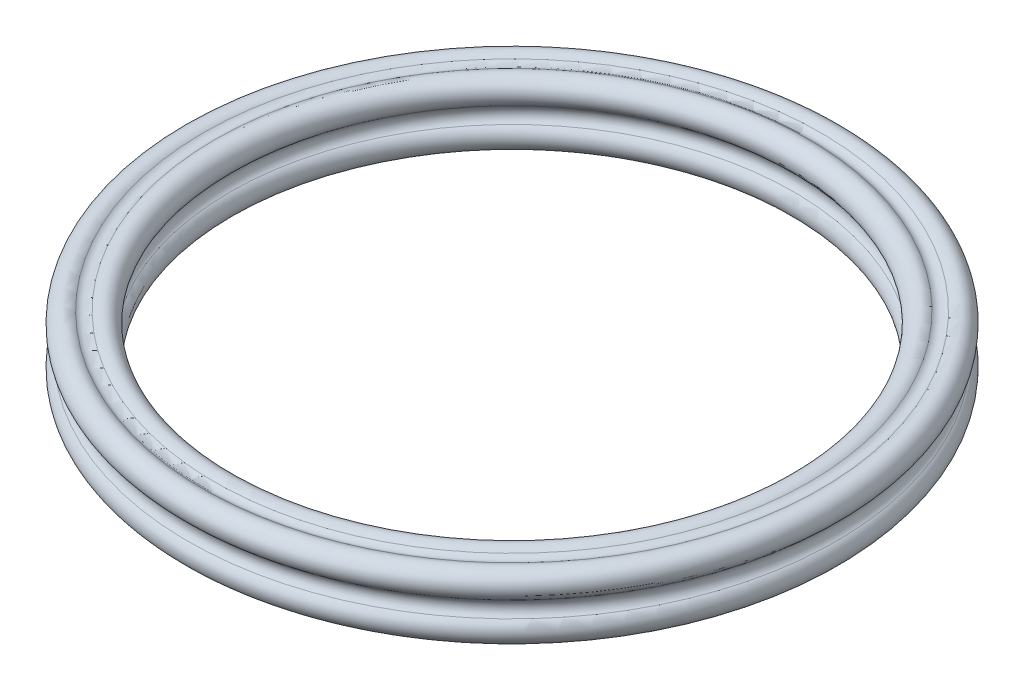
ISO-10303-21;
HEADER;
FILE_DESCRIPTION(('STEP AP214'),'2;1');
FILE_NAME('part.step','',(''),(''),'','','');
FILE_SCHEMA(('AUTOMOTIVE_DESIGN { 1 0 10303 214 1 1 1 1 }'));
ENDSEC;
DATA;
#1=APPLICATION_CONTEXT('core data for automotive mechanical design processes');
#2=APPLICATION_PROTOCOL_DEFINITION('international standard','automotive_design',2000,#1);
#3=PRODUCT_CONTEXT('',#1,'mechanical');
#4=PRODUCT('Part','Part','',(#3));
#5=PRODUCT_RELATED_PRODUCT_CATEGORY('part','',(#4));
#6=PRODUCT_DEFINITION_FORMATION('','',#4);
#7=PRODUCT_DEFINITION_CONTEXT('part definition',#1,'design');
#8=PRODUCT_DEFINITION('design','',#6,#7);
#9=PRODUCT_DEFINITION_SHAPE('','',#8);
#10=(LENGTH_UNIT() NAMED_UNIT(*) SI_UNIT(.MILLI.,.METRE.));
#11=(NAMED_UNIT(*) PLANE_ANGLE_UNIT() SI_UNIT($,.RADIAN.));
#12=(NAMED_UNIT(*) SI_UNIT($,.STERADIAN.) SOLID_ANGLE_UNIT());
#13=UNCERTAINTY_MEASURE_WITH_UNIT(LENGTH_MEASURE(1.E-05),#10,'distance_accuracy_value','');
#14=(GEOMETRIC_REPRESENTATION_CONTEXT(3) GLOBAL_UNCERTAINTY_ASSIGNED_CONTEXT((#13)) GLOBAL_UNIT_ASSIGNED_CONTEXT((#10,
#11,#12)) REPRESENTATION_CONTEXT('',''));
#15=CARTESIAN_POINT('',(0.,0.,0.));
#16=DIRECTION('',(0.,0.,1.));
#17=DIRECTION('',(1.,0.,0.));
#18=AXIS2_PLACEMENT_3D('',#15,#16,#17);
#19=CARTESIAN_POINT('',(0.,-0.33219918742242,0.));
#20=DIRECTION('',(0.,1.,0.));
#21=DIRECTION('',(-1.,0.,0.));
#22=AXIS2_PLACEMENT_3D('',#19,#20,#21);
#23=TOROIDAL_SURFACE('',#22,18.375,0.60089257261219);
#24=CARTESIAN_POINT('',(0.,0.153441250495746,0.));
#25=DIRECTION('',(0.,1.,0.));
#26=DIRECTION('',(-1.,0.,0.));
#27=AXIS2_PLACEMENT_3D('',#24,#25,#26);
#28=CIRCLE('',#27,18.0211282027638);
#29=CARTESIAN_POINT('',(-18.0211282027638,0.153441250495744,0.));
#30=VERTEX_POINT('',#29);
#31=EDGE_CURVE('E59',#30,#30,#28,.T.);
#32=ORIENTED_EDGE('',*,*,#31,.T.);
#33=EDGE_LOOP('',(#32));
#34=FACE_BOUND('',#33,.T.);
#35=CARTESIAN_POINT('',(0.,0.153441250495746,0.));
#36=DIRECTION('',(0.,1.,0.));
#37=DIRECTION('',(-1.,0.,0.));
#38=AXIS2_PLACEMENT_3D('',#35,#36,#37);
#39=CIRCLE('',#38,18.7288717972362);
#40=CARTESIAN_POINT('',(-18.7288717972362,0.153441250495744,0.));
#41=VERTEX_POINT('',#40);
#42=EDGE_CURVE('E10',#41,#41,#39,.T.);
#43=ORIENTED_EDGE('',*,*,#42,.F.);
#44=EDGE_LOOP('',(#43));
#45=FACE_BOUND('',#44,.T.);
#46=ADVANCED_FACE('F31',(#34,#45),#23,.F.);
#47=CARTESIAN_POINT('',(0.,0.800000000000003,0.));
#48=DIRECTION('',(0.,1.,0.));
#49=DIRECTION('',(-1.,0.,0.));
#50=AXIS2_PLACEMENT_3D('',#47,#48,#49);
#51=TOROIDAL_SURFACE('',#50,19.2,0.799999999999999);
#52=ORIENTED_EDGE('',*,*,#42,.T.);
#53=EDGE_LOOP('',(#52));
#54=FACE_BOUND('',#53,.T.);
#55=CARTESIAN_POINT('',(0.,1.45672416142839,0.));
#56=DIRECTION('',(0.,1.,0.));
#57=DIRECTION('',(-1.,0.,0.));
#58=AXIS2_PLACEMENT_3D('',#55,#56,#57);
#59=CIRCLE('',#58,19.6568515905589);
#60=CARTESIAN_POINT('',(-19.6568515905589,1.45672416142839,0.));
#61=VERTEX_POINT('',#60);
#62=EDGE_CURVE('E37',#61,#61,#59,.T.);
#63=ORIENTED_EDGE('',*,*,#62,.F.);
#64=EDGE_LOOP('',(#63));
#65=FACE_BOUND('',#64,.T.);
#66=ADVANCED_FACE('F77',(#54,#65),#51,.T.);
#67=CARTESIAN_POINT('',(0.,1.95,0.));
#68=DIRECTION('',(0.,1.,0.));
#69=DIRECTION('',(-1.,0.,0.));
#70=AXIS2_PLACEMENT_3D('',#67,#68,#69);
#71=TOROIDAL_SURFACE('',#70,20.,0.60089257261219);
#72=ORIENTED_EDGE('',*,*,#62,.T.);
#73=EDGE_LOOP('',(#72));
#74=FACE_BOUND('',#73,.T.);
#75=CARTESIAN_POINT('',(0.,2.44327583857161,0.));
#76=DIRECTION('',(0.,1.,0.));
#77=DIRECTION('',(-1.,0.,0.));
#78=AXIS2_PLACEMENT_3D('',#75,#76,#77);
#79=CIRCLE('',#78,19.6568515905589);
#80=CARTESIAN_POINT('',(-19.6568515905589,2.44327583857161,0.));
#81=VERTEX_POINT('',#80);
#82=EDGE_CURVE('E41',#81,#81,#79,.T.);
#83=ORIENTED_EDGE('',*,*,#82,.F.);
#84=EDGE_LOOP('',(#83));
#85=FACE_BOUND('',#84,.T.);
#86=ADVANCED_FACE('F81',(#74,#85),#71,.F.);
#87=CARTESIAN_POINT('',(0.,3.1,0.));
#88=DIRECTION('',(0.,1.,0.));
#89=DIRECTION('',(-1.,0.,0.));
#90=AXIS2_PLACEMENT_3D('',#87,#88,#89);
#91=TOROIDAL_SURFACE('',#90,19.2,0.799999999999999);
#92=ORIENTED_EDGE('',*,*,#82,.T.);
#93=EDGE_LOOP('',(#92));
#94=FACE_BOUND('',#93,.T.);
#95=CARTESIAN_POINT('',(0.,3.74655874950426,0.));
#96=DIRECTION('',(0.,1.,0.));
#97=DIRECTION('',(-1.,0.,0.));
#98=AXIS2_PLACEMENT_3D('',#95,#96,#97);
#99=CIRCLE('',#98,18.7288717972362);
#100=CARTESIAN_POINT('',(-18.7288717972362,3.74655874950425,0.));
#101=VERTEX_POINT('',#100);
#102=EDGE_CURVE('E45',#101,#101,#99,.T.);
#103=ORIENTED_EDGE('',*,*,#102,.F.);
#104=EDGE_LOOP('',(#103));
#105=FACE_BOUND('',#104,.T.);
#106=ADVANCED_FACE('F85',(#94,#105),#91,.T.);
#107=CARTESIAN_POINT('',(0.,4.23219918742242,0.));
#108=DIRECTION('',(0.,1.,0.));
#109=DIRECTION('',(-1.,0.,0.));
#110=AXIS2_PLACEMENT_3D('',#107,#108,#109);
#111=TOROIDAL_SURFACE('',#110,18.375,0.60089257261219);
#112=ORIENTED_EDGE('',*,*,#102,.T.);
#113=EDGE_LOOP('',(#112));
#114=FACE_BOUND('',#113,.T.);
#115=CARTESIAN_POINT('',(0.,3.74655874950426,0.));
#116=DIRECTION('',(0.,1.,0.));
#117=DIRECTION('',(-1.,0.,0.));
#118=AXIS2_PLACEMENT_3D('',#115,#116,#117);
#119=CIRCLE('',#118,18.0211282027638);
#120=CARTESIAN_POINT('',(-18.0211282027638,3.74655874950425,0.));
#121=VERTEX_POINT('',#120);
#122=EDGE_CURVE('E50',#121,#121,#119,.T.);
#123=ORIENTED_EDGE('',*,*,#122,.F.);
#124=EDGE_LOOP('',(#123));
#125=FACE_BOUND('',#124,.T.);
#126=ADVANCED_FACE('F91',(#114,#125),#111,.F.);
#127=CARTESIAN_POINT('',(0.,3.1,0.));
#128=DIRECTION('',(0.,1.,0.));
#129=DIRECTION('',(-1.,0.,0.));
#130=AXIS2_PLACEMENT_3D('',#127,#128,#129);
#131=TOROIDAL_SURFACE('',#130,17.55,0.799999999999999);
#132=ORIENTED_EDGE('',*,*,#122,.T.);
#133=EDGE_LOOP('',(#132));
#134=FACE_BOUND('',#133,.T.);
#135=CARTESIAN_POINT('',(0.,2.44327583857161,0.));
#136=DIRECTION('',(0.,1.,0.));
#137=DIRECTION('',(-1.,0.,0.));
#138=AXIS2_PLACEMENT_3D('',#135,#136,#137);
#139=CIRCLE('',#138,17.0931484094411);
#140=CARTESIAN_POINT('',(-17.0931484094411,2.44327583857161,0.));
#141=VERTEX_POINT('',#140);
#142=EDGE_CURVE('E53',#141,#141,#139,.T.);
#143=ORIENTED_EDGE('',*,*,#142,.F.);
#144=EDGE_LOOP('',(#143));
#145=FACE_BOUND('',#144,.T.);
#146=ADVANCED_FACE('F73',(#134,#145),#131,.T.);
#147=CARTESIAN_POINT('',(0.,1.95,0.));
#148=DIRECTION('',(0.,1.,0.));
#149=DIRECTION('',(-1.,0.,0.));
#150=AXIS2_PLACEMENT_3D('',#147,#148,#149);
#151=TOROIDAL_SURFACE('',#150,16.75,0.60089257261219);
#152=ORIENTED_EDGE('',*,*,#142,.T.);
#153=EDGE_LOOP('',(#152));
#154=FACE_BOUND('',#153,.T.);
#155=CARTESIAN_POINT('',(0.,1.45672416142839,0.));
#156=DIRECTION('',(0.,1.,0.));
#157=DIRECTION('',(-1.,0.,0.));
#158=AXIS2_PLACEMENT_3D('',#155,#156,#157);
#159=CIRCLE('',#158,17.0931484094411);
#160=CARTESIAN_POINT('',(-17.0931484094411,1.45672416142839,0.));
#161=VERTEX_POINT('',#160);
#162=EDGE_CURVE('E56',#161,#161,#159,.T.);
#163=ORIENTED_EDGE('',*,*,#162,.F.);
#164=EDGE_LOOP('',(#163));
#165=FACE_BOUND('',#164,.T.);
#166=ADVANCED_FACE('F67',(#154,#165),#151,.F.);
#167=CARTESIAN_POINT('',(0.,0.800000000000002,0.));
#168=DIRECTION('',(0.,1.,0.));
#169=DIRECTION('',(-1.,0.,0.));
#170=AXIS2_PLACEMENT_3D('',#167,#168,#169);
#171=TOROIDAL_SURFACE('',#170,17.55,0.799999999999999);
#172=ORIENTED_EDGE('',*,*,#162,.T.);
#173=EDGE_LOOP('',(#172));
#174=FACE_BOUND('',#173,.T.);
#175=ORIENTED_EDGE('',*,*,#31,.F.);
#176=EDGE_LOOP('',(#175));
#177=FACE_BOUND('',#176,.T.);
#178=ADVANCED_FACE('F65',(#174,#177),#171,.T.);
#179=CLOSED_SHELL('',(#46,#66,#86,#106,#126,#146,#166,#178));
#180=MANIFOLD_SOLID_BREP('B2',#179);
#181=ADVANCED_BREP_SHAPE_REPRESENTATION('',(#18,#180),#14);
#182=SHAPE_DEFINITION_REPRESENTATION(#9,#181);
ENDSEC;
END-ISO-10303-21;
